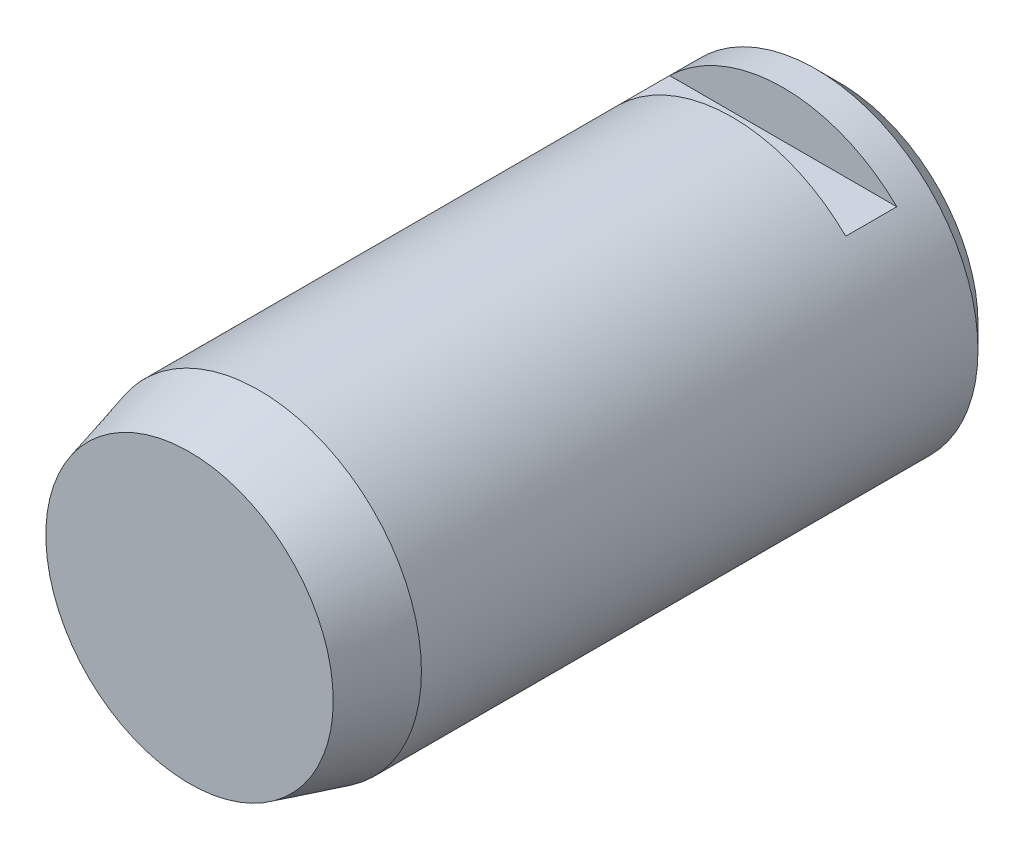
ISO-10303-21;
HEADER;
FILE_DESCRIPTION(('STEP AP214'),'2;1');
FILE_NAME('part.step','',(''),(''),'','','');
FILE_SCHEMA(('AUTOMOTIVE_DESIGN { 1 0 10303 214 1 1 1 1 }'));
ENDSEC;
DATA;
#1=APPLICATION_CONTEXT('core data for automotive mechanical design processes');
#2=APPLICATION_PROTOCOL_DEFINITION('international standard','automotive_design',2000,#1);
#3=PRODUCT_CONTEXT('',#1,'mechanical');
#4=PRODUCT('Part','Part','',(#3));
#5=PRODUCT_RELATED_PRODUCT_CATEGORY('part','',(#4));
#6=PRODUCT_DEFINITION_FORMATION('','',#4);
#7=PRODUCT_DEFINITION_CONTEXT('part definition',#1,'design');
#8=PRODUCT_DEFINITION('design','',#6,#7);
#9=PRODUCT_DEFINITION_SHAPE('','',#8);
#10=(LENGTH_UNIT() NAMED_UNIT(*) SI_UNIT(.MILLI.,.METRE.));
#11=(NAMED_UNIT(*) PLANE_ANGLE_UNIT() SI_UNIT($,.RADIAN.));
#12=(NAMED_UNIT(*) SI_UNIT($,.STERADIAN.) SOLID_ANGLE_UNIT());
#13=UNCERTAINTY_MEASURE_WITH_UNIT(LENGTH_MEASURE(1.E-05),#10,'distance_accuracy_value','');
#14=(GEOMETRIC_REPRESENTATION_CONTEXT(3) GLOBAL_UNCERTAINTY_ASSIGNED_CONTEXT((#13)) GLOBAL_UNIT_ASSIGNED_CONTEXT((#10,
#11,#12)) REPRESENTATION_CONTEXT('',''));
#15=CARTESIAN_POINT('',(0.,0.,0.));
#16=DIRECTION('',(0.,0.,1.));
#17=DIRECTION('',(1.,0.,0.));
#18=AXIS2_PLACEMENT_3D('',#15,#16,#17);
#19=CARTESIAN_POINT('',(0.,0.,140.));
#20=DIRECTION('',(0.,0.,-1.));
#21=DIRECTION('',(-1.,0.,0.));
#22=AXIS2_PLACEMENT_3D('',#19,#20,#21);
#23=CYLINDRICAL_SURFACE('',#22,35.);
#24=CARTESIAN_POINT('',(0.,0.,5.00000000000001));
#25=DIRECTION('',(0.,0.,1.));
#26=DIRECTION('',(1.,0.,0.));
#27=AXIS2_PLACEMENT_3D('',#24,#25,#26);
#28=CIRCLE('',#27,35.);
#29=CARTESIAN_POINT('',(35.,0.,5.00000000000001));
#30=VERTEX_POINT('',#29);
#31=EDGE_CURVE('E43',#30,#30,#28,.T.);
#32=ORIENTED_EDGE('',*,*,#31,.T.);
#33=EDGE_LOOP('',(#32));
#34=FACE_BOUND('',#33,.T.);
#35=CARTESIAN_POINT('',(0.,0.,23.));
#36=DIRECTION('',(0.,0.,-1.));
#37=DIRECTION('',(-1.,0.,0.));
#38=AXIS2_PLACEMENT_3D('',#35,#36,#37);
#39=CIRCLE('',#38,35.);
#40=CARTESIAN_POINT('',(24.4948974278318,25.,23.));
#41=VERTEX_POINT('',#40);
#42=CARTESIAN_POINT('',(-24.4948974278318,25.,23.));
#43=VERTEX_POINT('',#42);
#44=EDGE_CURVE('E49',#41,#43,#39,.F.);
#45=ORIENTED_EDGE('',*,*,#44,.T.);
#46=DIRECTION('',(0.,0.,-1.));
#47=VECTOR('',#46,1.);
#48=CARTESIAN_POINT('',(-24.4948974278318,25.,140.));
#49=LINE('',#48,#47);
#50=CARTESIAN_POINT('',(-24.4948974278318,25.,12.));
#51=VERTEX_POINT('',#50);
#52=EDGE_CURVE('E73',#51,#43,#49,.F.);
#53=ORIENTED_EDGE('',*,*,#52,.F.);
#54=CARTESIAN_POINT('',(0.,0.,12.));
#55=DIRECTION('',(0.,0.,1.));
#56=DIRECTION('',(1.,0.,0.));
#57=AXIS2_PLACEMENT_3D('',#54,#55,#56);
#58=CIRCLE('',#57,35.);
#59=CARTESIAN_POINT('',(24.4948974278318,25.,12.));
#60=VERTEX_POINT('',#59);
#61=EDGE_CURVE('E65',#51,#60,#58,.F.);
#62=ORIENTED_EDGE('',*,*,#61,.T.);
#63=DIRECTION('',(0.,0.,-1.));
#64=VECTOR('',#63,1.);
#65=CARTESIAN_POINT('',(24.4948974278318,25.,140.));
#66=LINE('',#65,#64);
#67=EDGE_CURVE('E70',#41,#60,#66,.T.);
#68=ORIENTED_EDGE('',*,*,#67,.F.);
#69=EDGE_LOOP('',(#45,#53,#62,#68));
#70=FACE_BOUND('',#69,.T.);
#71=CARTESIAN_POINT('',(0.,0.,125.));
#72=DIRECTION('',(0.,0.,1.));
#73=DIRECTION('',(1.,0.,0.));
#74=AXIS2_PLACEMENT_3D('',#71,#72,#73);
#75=CIRCLE('',#74,35.);
#76=CARTESIAN_POINT('',(35.,0.,125.));
#77=VERTEX_POINT('',#76);
#78=EDGE_CURVE('E84',#77,#77,#75,.F.);
#79=ORIENTED_EDGE('',*,*,#78,.T.);
#80=EDGE_LOOP('',(#79));
#81=FACE_BOUND('',#80,.T.);
#82=ADVANCED_FACE('F36',(#34,#70,#81),#23,.T.);
#83=CARTESIAN_POINT('',(0.,0.,140.));
#84=DIRECTION('',(0.,0.,1.));
#85=DIRECTION('',(1.,0.,0.));
#86=AXIS2_PLACEMENT_3D('',#83,#84,#85);
#87=PLANE('',#86);
#88=CARTESIAN_POINT('',(0.,0.,140.));
#89=DIRECTION('',(0.,0.,1.));
#90=DIRECTION('',(1.,0.,0.));
#91=AXIS2_PLACEMENT_3D('',#88,#89,#90);
#92=CIRCLE('',#91,30.9807621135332);
#93=CARTESIAN_POINT('',(30.9807621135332,0.,140.));
#94=VERTEX_POINT('',#93);
#95=EDGE_CURVE('E81',#94,#94,#92,.T.);
#96=ORIENTED_EDGE('',*,*,#95,.T.);
#97=EDGE_LOOP('',(#96));
#98=FACE_BOUND('',#97,.T.);
#99=ADVANCED_FACE('F101',(#98),#87,.T.);
#100=CARTESIAN_POINT('',(0.,0.,0.));
#101=DIRECTION('',(0.,0.,1.));
#102=DIRECTION('',(1.,0.,0.));
#103=AXIS2_PLACEMENT_3D('',#100,#101,#102);
#104=PLANE('',#103);
#105=CARTESIAN_POINT('',(0.,0.,0.));
#106=DIRECTION('',(0.,0.,1.));
#107=DIRECTION('',(1.,0.,0.));
#108=AXIS2_PLACEMENT_3D('',#105,#106,#107);
#109=CIRCLE('',#108,30.);
#110=CARTESIAN_POINT('',(30.,0.,0.));
#111=VERTEX_POINT('',#110);
#112=EDGE_CURVE('E11',#111,#111,#109,.F.);
#113=ORIENTED_EDGE('',*,*,#112,.T.);
#114=EDGE_LOOP('',(#113));
#115=FACE_BOUND('',#114,.T.);
#116=ADVANCED_FACE('F105',(#115),#104,.F.);
#117=CARTESIAN_POINT('',(0.,0.,140.));
#118=DIRECTION('',(0.,0.,-1.));
#119=DIRECTION('',(-1.,0.,0.));
#120=AXIS2_PLACEMENT_3D('',#117,#118,#119);
#121=CONICAL_SURFACE('',#120,30.9807621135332,0.261799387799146);
#122=ORIENTED_EDGE('',*,*,#78,.F.);
#123=EDGE_LOOP('',(#122));
#124=FACE_BOUND('',#123,.T.);
#125=ORIENTED_EDGE('',*,*,#95,.F.);
#126=EDGE_LOOP('',(#125));
#127=FACE_BOUND('',#126,.T.);
#128=ADVANCED_FACE('F110',(#124,#127),#121,.T.);
#129=CARTESIAN_POINT('',(35.,35.001,12.));
#130=DIRECTION('',(0.,0.,1.));
#131=DIRECTION('',(1.,0.,0.));
#132=AXIS2_PLACEMENT_3D('',#129,#130,#131);
#133=PLANE('',#132);
#134=DIRECTION('',(-1.,0.,0.));
#135=VECTOR('',#134,1.);
#136=CARTESIAN_POINT('',(35.,25.,12.));
#137=LINE('',#136,#135);
#138=EDGE_CURVE('E57',#60,#51,#137,.T.);
#139=ORIENTED_EDGE('',*,*,#138,.F.);
#140=ORIENTED_EDGE('',*,*,#61,.F.);
#141=EDGE_LOOP('',(#139,#140));
#142=FACE_BOUND('',#141,.T.);
#143=ADVANCED_FACE('F63',(#142),#133,.T.);
#144=CARTESIAN_POINT('',(35.,35.001,23.));
#145=DIRECTION('',(0.,0.,-1.));
#146=DIRECTION('',(-1.,0.,0.));
#147=AXIS2_PLACEMENT_3D('',#144,#145,#146);
#148=PLANE('',#147);
#149=DIRECTION('',(1.,0.,0.));
#150=VECTOR('',#149,1.);
#151=CARTESIAN_POINT('',(35.,25.,23.));
#152=LINE('',#151,#150);
#153=EDGE_CURVE('E67',#43,#41,#152,.T.);
#154=ORIENTED_EDGE('',*,*,#153,.F.);
#155=ORIENTED_EDGE('',*,*,#44,.F.);
#156=EDGE_LOOP('',(#154,#155));
#157=FACE_BOUND('',#156,.T.);
#158=ADVANCED_FACE('F97',(#157),#148,.T.);
#159=CARTESIAN_POINT('',(35.,25.,23.));
#160=DIRECTION('',(0.,-1.,0.));
#161=DIRECTION('',(0.,0.,-1.));
#162=AXIS2_PLACEMENT_3D('',#159,#160,#161);
#163=PLANE('',#162);
#164=ORIENTED_EDGE('',*,*,#52,.T.);
#165=ORIENTED_EDGE('',*,*,#153,.T.);
#166=ORIENTED_EDGE('',*,*,#67,.T.);
#167=ORIENTED_EDGE('',*,*,#138,.T.);
#168=EDGE_LOOP('',(#164,#165,#166,#167));
#169=FACE_BOUND('',#168,.T.);
#170=ADVANCED_FACE('F71',(#169),#163,.F.);
#171=CARTESIAN_POINT('',(0.,0.,5.00000000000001));
#172=DIRECTION('',(0.,0.,1.));
#173=DIRECTION('',(1.,0.,0.));
#174=AXIS2_PLACEMENT_3D('',#171,#172,#173);
#175=CONICAL_SURFACE('',#174,35.,0.78539816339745);
#176=ORIENTED_EDGE('',*,*,#112,.F.);
#177=EDGE_LOOP('',(#176));
#178=FACE_BOUND('',#177,.T.);
#179=ORIENTED_EDGE('',*,*,#31,.F.);
#180=EDGE_LOOP('',(#179));
#181=FACE_BOUND('',#180,.T.);
#182=ADVANCED_FACE('F90',(#178,#181),#175,.T.);
#183=CLOSED_SHELL('',(#82,#99,#116,#128,#143,#158,#170,#182));
#184=MANIFOLD_SOLID_BREP('B2',#183);
#185=ADVANCED_BREP_SHAPE_REPRESENTATION('',(#18,#184),#14);
#186=SHAPE_DEFINITION_REPRESENTATION(#9,#185);
ENDSEC;
END-ISO-10303-21;
